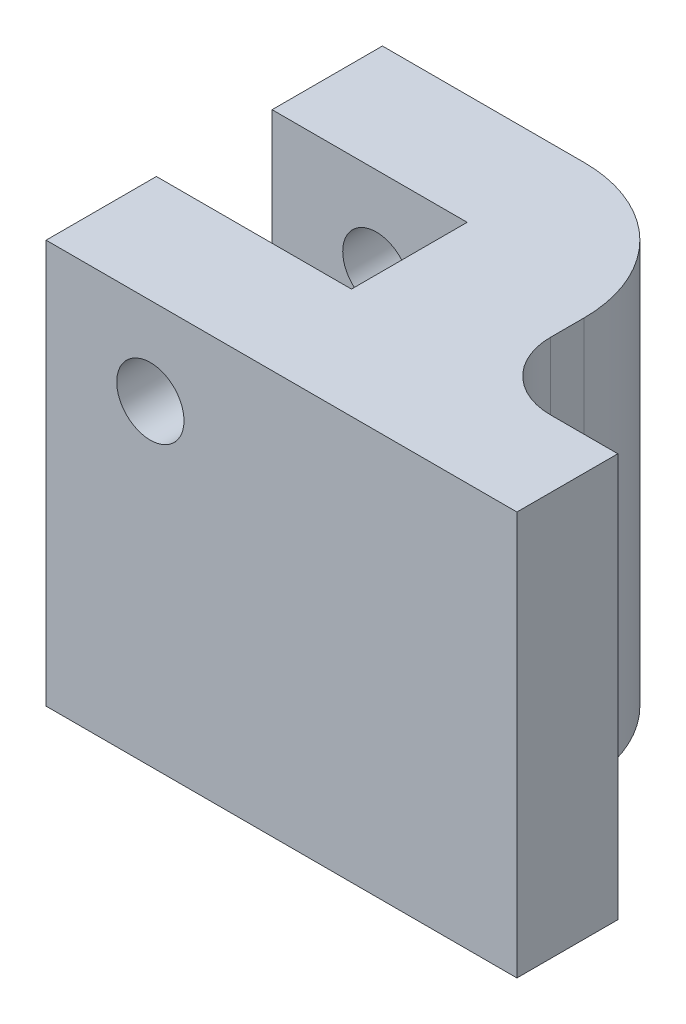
from build123d import *

# Parameters (mm, degrees)
SKETCH1_W           = 44.45
SKETCH1_H           = 38.1
SKETCH1_R           = 3.175
BOSS_EXTRUDE1_DEPTH = 31.75
SKETCH2_W           = 18.415
SKETCH2_H           = 10.922
CUT_EXTRUDE1_DEPTH  = 16.7132
SKETCH3_R           = 2.0193
CUT_EXTRUDE2_DEPTH  = 19.05
SKETCH4_R           = 2.0193
CUT_EXTRUDE3_DEPTH  = 67.599361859
FILLET1_R           = 12.7


with BuildPart() as part:
    # Sketch1 → Boss-Extrude1 (new body)
    with BuildSketch(Plane.XY):
        with Locations((22.225, 19.05)):
            Rectangle(SKETCH1_W, SKETCH1_H)
        with Locations((9.8425, 29.845)):
            Circle(SKETCH1_R, mode=Mode.SUBTRACT)
    extrude(amount=BOSS_EXTRUDE1_DEPTH)

    # Sketch2 → Cut-Extrude1 (cut)
    with BuildSketch(Plane(origin=(0, 38.1, 0), x_dir=(1, 0, 0), z_dir=(0, 1, 0))):
        with Locations((9.2075, -15.875)):
            Rectangle(SKETCH2_W, SKETCH2_H)
    extrude(amount=-CUT_EXTRUDE1_DEPTH, mode=Mode.SUBTRACT)

    # Sketch3 → Cut-Extrude2 (cut)
    with BuildSketch(Plane.XZ):
        with Locations(Location((12.7, 26.035, 0), (0, 0, 270))):
            Circle(SKETCH3_R)
        with Locations(Location((38.1, 26.035, 0), (0, 0, 270))):
            Circle(SKETCH3_R)
        with Locations(Location((38.1, 5.715, 0), (0, 0, 270))):
            Circle(SKETCH3_R)
        with Locations(Location((12.7, 5.715, 0), (0, 0, 270))):
            Circle(SKETCH3_R)
    extrude(amount=-CUT_EXTRUDE2_DEPTH, mode=Mode.SUBTRACT)

    # Sketch4 → Cut-Extrude3 (cut, through all)
    # profile 1 of 2: a face of its own
    with BuildSketch(Plane.XZ):
        with BuildLine():
            Line((44.45, 9.525), (44.45, 22.225))
            Line((44.45, 22.225), (38.1, 22.225))
            ThreePointArc((38.1, 22.225), (33.609871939, 20.365128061), (31.75, 15.875))
            ThreePointArc((31.75, 15.875), (33.609871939, 11.384871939), (38.1, 9.525))
            Line((38.1, 9.525), (44.45, 9.525))
        make_face()
    # profile 2 of 2: a face of its own
    with BuildSketch(Plane.XZ):
        with BuildLine():
            Line((44.45, 0), (44.45, 9.525))
            Line((44.45, 9.525), (38.1, 9.525))
            ThreePointArc((38.1, 9.525), (33.609871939, 11.384871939), (31.75, 15.875))
            Line((31.75, 15.875), (31.75, 0))
            Line((31.75, 0), (44.45, 0))
        make_face()
        with Locations((38.1, 5.715)):
            Circle(SKETCH4_R, mode=Mode.SUBTRACT)
    extrude(amount=-CUT_EXTRUDE3_DEPTH, mode=Mode.SUBTRACT)


with BuildPart() as cut_extrude3_kept_piece:
    # of the separate pieces the step leaves, the one the design keeps (cut_extrude3_pieces_kept)
    add(part.part.solids().sort_by_distance((0, 0, 0))[0])

    # Fillet1
    fillet1_edges = [cut_extrude3_kept_piece.edges().sort_by_distance(p)[0] for p in [
        (31.75, 19.05, 0),
    ]]
    fillet(fillet1_edges, radius=FILLET1_R)


solid = cut_extrude3_kept_piece.part
